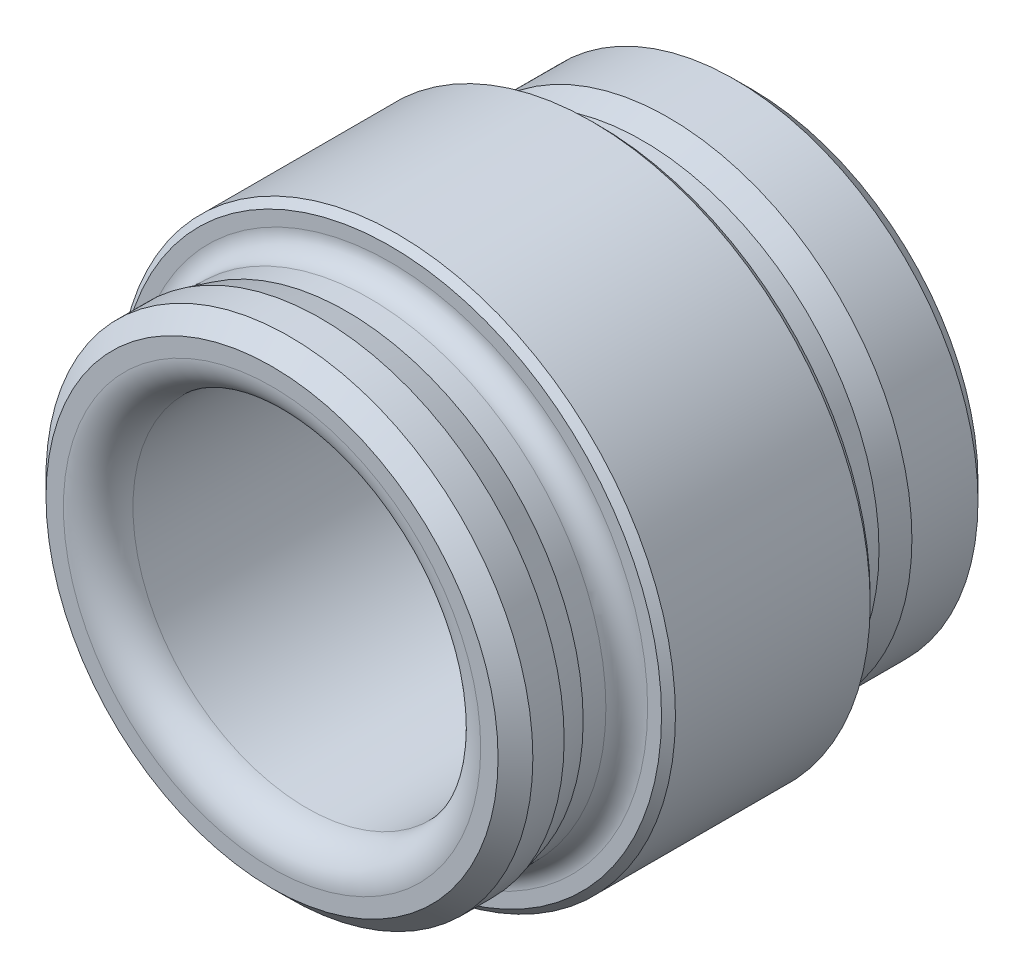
ISO-10303-21;
HEADER;
FILE_DESCRIPTION(('STEP AP214'),'2;1');
FILE_NAME('part.step','',(''),(''),'','','');
FILE_SCHEMA(('AUTOMOTIVE_DESIGN { 1 0 10303 214 1 1 1 1 }'));
ENDSEC;
DATA;
#1=APPLICATION_CONTEXT('core data for automotive mechanical design processes');
#2=APPLICATION_PROTOCOL_DEFINITION('international standard','automotive_design',2000,#1);
#3=PRODUCT_CONTEXT('',#1,'mechanical');
#4=PRODUCT('Part','Part','',(#3));
#5=PRODUCT_RELATED_PRODUCT_CATEGORY('part','',(#4));
#6=PRODUCT_DEFINITION_FORMATION('','',#4);
#7=PRODUCT_DEFINITION_CONTEXT('part definition',#1,'design');
#8=PRODUCT_DEFINITION('design','',#6,#7);
#9=PRODUCT_DEFINITION_SHAPE('','',#8);
#10=(LENGTH_UNIT() NAMED_UNIT(*) SI_UNIT(.MILLI.,.METRE.));
#11=(NAMED_UNIT(*) PLANE_ANGLE_UNIT() SI_UNIT($,.RADIAN.));
#12=(NAMED_UNIT(*) SI_UNIT($,.STERADIAN.) SOLID_ANGLE_UNIT());
#13=UNCERTAINTY_MEASURE_WITH_UNIT(LENGTH_MEASURE(1.E-05),#10,'distance_accuracy_value','');
#14=(GEOMETRIC_REPRESENTATION_CONTEXT(3) GLOBAL_UNCERTAINTY_ASSIGNED_CONTEXT((#13)) GLOBAL_UNIT_ASSIGNED_CONTEXT((#10,
#11,#12)) REPRESENTATION_CONTEXT('',''));
#15=CARTESIAN_POINT('',(0.,0.,0.));
#16=DIRECTION('',(0.,0.,1.));
#17=DIRECTION('',(1.,0.,0.));
#18=AXIS2_PLACEMENT_3D('',#15,#16,#17);
#19=CARTESIAN_POINT('',(0.,0.,8.40000000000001));
#20=DIRECTION('',(0.,0.,1.));
#21=DIRECTION('',(1.,0.,0.));
#22=AXIS2_PLACEMENT_3D('',#19,#20,#21);
#23=TOROIDAL_SURFACE('',#22,6.,0.999999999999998);
#24=CARTESIAN_POINT('',(0.,0.,8.40000000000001));
#25=DIRECTION('',(0.,0.,1.));
#26=DIRECTION('',(1.,0.,0.));
#27=AXIS2_PLACEMENT_3D('',#24,#25,#26);
#28=CIRCLE('',#27,5.);
#29=CARTESIAN_POINT('',(5.,0.,8.40000000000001));
#30=VERTEX_POINT('',#29);
#31=EDGE_CURVE('E10',#30,#30,#28,.T.);
#32=ORIENTED_EDGE('',*,*,#31,.F.);
#33=EDGE_LOOP('',(#32));
#34=FACE_BOUND('',#33,.T.);
#35=CARTESIAN_POINT('',(0.,0.,9.40000000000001));
#36=DIRECTION('',(0.,0.,1.));
#37=DIRECTION('',(1.,0.,0.));
#38=AXIS2_PLACEMENT_3D('',#35,#36,#37);
#39=CIRCLE('',#38,6.);
#40=CARTESIAN_POINT('',(6.,0.,9.40000000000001));
#41=VERTEX_POINT('',#40);
#42=EDGE_CURVE('E95',#41,#41,#39,.T.);
#43=ORIENTED_EDGE('',*,*,#42,.T.);
#44=EDGE_LOOP('',(#43));
#45=FACE_BOUND('',#44,.T.);
#46=ADVANCED_FACE('F34',(#34,#45),#23,.T.);
#47=CARTESIAN_POINT('',(0.,0.,9.40000000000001));
#48=DIRECTION('',(0.,0.,1.));
#49=DIRECTION('',(1.,0.,0.));
#50=AXIS2_PLACEMENT_3D('',#47,#48,#49);
#51=CYLINDRICAL_SURFACE('',#50,5.);
#52=CARTESIAN_POINT('',(0.,0.,-4.39999999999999));
#53=DIRECTION('',(0.,0.,1.));
#54=DIRECTION('',(1.,0.,0.));
#55=AXIS2_PLACEMENT_3D('',#52,#53,#54);
#56=CIRCLE('',#55,5.);
#57=CARTESIAN_POINT('',(5.,0.,-4.39999999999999));
#58=VERTEX_POINT('',#57);
#59=EDGE_CURVE('E40',#58,#58,#56,.T.);
#60=ORIENTED_EDGE('',*,*,#59,.F.);
#61=EDGE_LOOP('',(#60));
#62=FACE_BOUND('',#61,.T.);
#63=ORIENTED_EDGE('',*,*,#31,.T.);
#64=EDGE_LOOP('',(#63));
#65=FACE_BOUND('',#64,.T.);
#66=ADVANCED_FACE('F198',(#62,#65),#51,.F.);
#67=CARTESIAN_POINT('',(0.,5.,-4.39999999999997));
#68=DIRECTION('',(0.,0.,1.));
#69=DIRECTION('',(1.,0.,0.));
#70=AXIS2_PLACEMENT_3D('',#67,#68,#69);
#71=PLANE('',#70);
#72=CARTESIAN_POINT('',(0.,0.,-4.39999999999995));
#73=DIRECTION('',(0.,0.,1.));
#74=DIRECTION('',(1.,0.,0.));
#75=AXIS2_PLACEMENT_3D('',#72,#73,#74);
#76=CIRCLE('',#75,6.49999999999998);
#77=CARTESIAN_POINT('',(6.49999999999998,0.,-4.39999999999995));
#78=VERTEX_POINT('',#77);
#79=EDGE_CURVE('E44',#78,#78,#76,.T.);
#80=ORIENTED_EDGE('',*,*,#79,.F.);
#81=EDGE_LOOP('',(#80));
#82=FACE_BOUND('',#81,.T.);
#83=ORIENTED_EDGE('',*,*,#59,.T.);
#84=EDGE_LOOP('',(#83));
#85=FACE_BOUND('',#84,.T.);
#86=ADVANCED_FACE('F193',(#82,#85),#71,.F.);
#87=CARTESIAN_POINT('',(0.,0.,-4.39999999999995));
#88=DIRECTION('',(0.,0.,1.));
#89=DIRECTION('',(1.,0.,0.));
#90=AXIS2_PLACEMENT_3D('',#87,#88,#89);
#91=CONICAL_SURFACE('',#90,6.49999999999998,0.785398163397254);
#92=CARTESIAN_POINT('',(0.,0.,-3.89999999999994));
#93=DIRECTION('',(0.,0.,1.));
#94=DIRECTION('',(1.,0.,0.));
#95=AXIS2_PLACEMENT_3D('',#92,#93,#94);
#96=CIRCLE('',#95,6.99999999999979);
#97=CARTESIAN_POINT('',(6.99999999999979,0.,-3.89999999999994));
#98=VERTEX_POINT('',#97);
#99=EDGE_CURVE('E48',#98,#98,#96,.T.);
#100=ORIENTED_EDGE('',*,*,#99,.F.);
#101=EDGE_LOOP('',(#100));
#102=FACE_BOUND('',#101,.T.);
#103=ORIENTED_EDGE('',*,*,#79,.T.);
#104=EDGE_LOOP('',(#103));
#105=FACE_BOUND('',#104,.T.);
#106=ADVANCED_FACE('F187',(#102,#105),#91,.T.);
#107=CARTESIAN_POINT('',(0.,0.,9.40000000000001));
#108=DIRECTION('',(0.,0.,1.));
#109=DIRECTION('',(1.,0.,0.));
#110=AXIS2_PLACEMENT_3D('',#107,#108,#109);
#111=CYLINDRICAL_SURFACE('',#110,6.99999999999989);
#112=CARTESIAN_POINT('',(0.,0.,-2.));
#113=DIRECTION('',(0.,0.,1.));
#114=DIRECTION('',(1.,0.,0.));
#115=AXIS2_PLACEMENT_3D('',#112,#113,#114);
#116=CIRCLE('',#115,7.);
#117=CARTESIAN_POINT('',(7.,0.,-2.));
#118=VERTEX_POINT('',#117);
#119=EDGE_CURVE('E53',#118,#118,#116,.T.);
#120=ORIENTED_EDGE('',*,*,#119,.F.);
#121=EDGE_LOOP('',(#120));
#122=FACE_BOUND('',#121,.T.);
#123=ORIENTED_EDGE('',*,*,#99,.T.);
#124=EDGE_LOOP('',(#123));
#125=FACE_BOUND('',#124,.T.);
#126=ADVANCED_FACE('F181',(#122,#125),#111,.T.);
#127=CARTESIAN_POINT('',(0.,0.,-2.));
#128=DIRECTION('',(0.,0.,-1.));
#129=DIRECTION('',(-1.,0.,0.));
#130=AXIS2_PLACEMENT_3D('',#127,#128,#129);
#131=CONICAL_SURFACE('',#130,7.,0.261799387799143);
#132=CARTESIAN_POINT('',(0.,0.,-1.2535898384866));
#133=DIRECTION('',(0.,0.,1.));
#134=DIRECTION('',(1.,0.,0.));
#135=AXIS2_PLACEMENT_3D('',#132,#133,#134);
#136=CIRCLE('',#135,6.80000000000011);
#137=CARTESIAN_POINT('',(6.80000000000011,0.,-1.2535898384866));
#138=VERTEX_POINT('',#137);
#139=EDGE_CURVE('E56',#138,#138,#136,.T.);
#140=ORIENTED_EDGE('',*,*,#139,.F.);
#141=EDGE_LOOP('',(#140));
#142=FACE_BOUND('',#141,.T.);
#143=ORIENTED_EDGE('',*,*,#119,.T.);
#144=EDGE_LOOP('',(#143));
#145=FACE_BOUND('',#144,.T.);
#146=ADVANCED_FACE('F175',(#142,#145),#131,.T.);
#147=CARTESIAN_POINT('',(0.,0.,9.40000000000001));
#148=DIRECTION('',(0.,0.,1.));
#149=DIRECTION('',(1.,0.,0.));
#150=AXIS2_PLACEMENT_3D('',#147,#148,#149);
#151=CYLINDRICAL_SURFACE('',#150,6.80000000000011);
#152=CARTESIAN_POINT('',(0.,0.,-0.6));
#153=DIRECTION('',(0.,0.,1.));
#154=DIRECTION('',(1.,0.,0.));
#155=AXIS2_PLACEMENT_3D('',#152,#153,#154);
#156=CIRCLE('',#155,6.80000000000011);
#157=CARTESIAN_POINT('',(6.80000000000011,0.,-0.6));
#158=VERTEX_POINT('',#157);
#159=EDGE_CURVE('E59',#158,#158,#156,.T.);
#160=ORIENTED_EDGE('',*,*,#159,.F.);
#161=EDGE_LOOP('',(#160));
#162=FACE_BOUND('',#161,.T.);
#163=ORIENTED_EDGE('',*,*,#139,.T.);
#164=EDGE_LOOP('',(#163));
#165=FACE_BOUND('',#164,.T.);
#166=ADVANCED_FACE('F169',(#162,#165),#151,.T.);
#167=CARTESIAN_POINT('',(0.,0.,-0.6));
#168=DIRECTION('',(0.,0.,1.));
#169=DIRECTION('',(1.,0.,0.));
#170=AXIS2_PLACEMENT_3D('',#167,#168,#169);
#171=TOROIDAL_SURFACE('',#170,7.40000000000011,0.599999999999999);
#172=CARTESIAN_POINT('',(0.,0.,0.));
#173=DIRECTION('',(0.,0.,1.));
#174=DIRECTION('',(1.,0.,0.));
#175=AXIS2_PLACEMENT_3D('',#172,#173,#174);
#176=CIRCLE('',#175,7.40000000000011);
#177=CARTESIAN_POINT('',(7.40000000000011,0.,0.));
#178=VERTEX_POINT('',#177);
#179=EDGE_CURVE('E62',#178,#178,#176,.T.);
#180=ORIENTED_EDGE('',*,*,#179,.F.);
#181=EDGE_LOOP('',(#180));
#182=FACE_BOUND('',#181,.T.);
#183=ORIENTED_EDGE('',*,*,#159,.T.);
#184=EDGE_LOOP('',(#183));
#185=FACE_BOUND('',#184,.T.);
#186=ADVANCED_FACE('F163',(#182,#185),#171,.F.);
#187=CARTESIAN_POINT('',(0.,7.40000000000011,0.));
#188=DIRECTION('',(0.,0.,1.));
#189=DIRECTION('',(1.,0.,0.));
#190=AXIS2_PLACEMENT_3D('',#187,#188,#189);
#191=PLANE('',#190);
#192=CARTESIAN_POINT('',(0.,0.,0.));
#193=DIRECTION('',(0.,0.,1.));
#194=DIRECTION('',(1.,0.,0.));
#195=AXIS2_PLACEMENT_3D('',#192,#193,#194);
#196=CIRCLE('',#195,7.8);
#197=CARTESIAN_POINT('',(7.8,0.,0.));
#198=VERTEX_POINT('',#197);
#199=EDGE_CURVE('E65',#198,#198,#196,.T.);
#200=ORIENTED_EDGE('',*,*,#199,.F.);
#201=EDGE_LOOP('',(#200));
#202=FACE_BOUND('',#201,.T.);
#203=ORIENTED_EDGE('',*,*,#179,.T.);
#204=EDGE_LOOP('',(#203));
#205=FACE_BOUND('',#204,.T.);
#206=ADVANCED_FACE('F157',(#202,#205),#191,.F.);
#207=CARTESIAN_POINT('',(0.,0.,0.));
#208=DIRECTION('',(0.,0.,1.));
#209=DIRECTION('',(1.,0.,0.));
#210=AXIS2_PLACEMENT_3D('',#207,#208,#209);
#211=CONICAL_SURFACE('',#210,7.8,0.785398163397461);
#212=CARTESIAN_POINT('',(0.,0.,0.200000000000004));
#213=DIRECTION('',(0.,0.,1.));
#214=DIRECTION('',(1.,0.,0.));
#215=AXIS2_PLACEMENT_3D('',#212,#213,#214);
#216=CIRCLE('',#215,8.);
#217=CARTESIAN_POINT('',(8.,0.,0.200000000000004));
#218=VERTEX_POINT('',#217);
#219=EDGE_CURVE('E68',#218,#218,#216,.T.);
#220=ORIENTED_EDGE('',*,*,#219,.F.);
#221=EDGE_LOOP('',(#220));
#222=FACE_BOUND('',#221,.T.);
#223=ORIENTED_EDGE('',*,*,#199,.T.);
#224=EDGE_LOOP('',(#223));
#225=FACE_BOUND('',#224,.T.);
#226=ADVANCED_FACE('F151',(#222,#225),#211,.T.);
#227=CARTESIAN_POINT('',(0.,0.,9.40000000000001));
#228=DIRECTION('',(0.,0.,1.));
#229=DIRECTION('',(1.,0.,0.));
#230=AXIS2_PLACEMENT_3D('',#227,#228,#229);
#231=CYLINDRICAL_SURFACE('',#230,8.);
#232=CARTESIAN_POINT('',(0.,0.,5.80000000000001));
#233=DIRECTION('',(0.,0.,1.));
#234=DIRECTION('',(1.,0.,0.));
#235=AXIS2_PLACEMENT_3D('',#232,#233,#234);
#236=CIRCLE('',#235,8.);
#237=CARTESIAN_POINT('',(8.,0.,5.80000000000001));
#238=VERTEX_POINT('',#237);
#239=EDGE_CURVE('E71',#238,#238,#236,.T.);
#240=ORIENTED_EDGE('',*,*,#239,.F.);
#241=EDGE_LOOP('',(#240));
#242=FACE_BOUND('',#241,.T.);
#243=ORIENTED_EDGE('',*,*,#219,.T.);
#244=EDGE_LOOP('',(#243));
#245=FACE_BOUND('',#244,.T.);
#246=ADVANCED_FACE('F145',(#242,#245),#231,.T.);
#247=CARTESIAN_POINT('',(0.,0.,5.80000000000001));
#248=DIRECTION('',(0.,0.,-1.));
#249=DIRECTION('',(-1.,0.,0.));
#250=AXIS2_PLACEMENT_3D('',#247,#248,#249);
#251=CONICAL_SURFACE('',#250,8.,0.785398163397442);
#252=CARTESIAN_POINT('',(0.,0.,6.00000000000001));
#253=DIRECTION('',(0.,0.,1.));
#254=DIRECTION('',(1.,0.,0.));
#255=AXIS2_PLACEMENT_3D('',#252,#253,#254);
#256=CIRCLE('',#255,7.8);
#257=CARTESIAN_POINT('',(7.8,0.,6.00000000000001));
#258=VERTEX_POINT('',#257);
#259=EDGE_CURVE('E74',#258,#258,#256,.T.);
#260=ORIENTED_EDGE('',*,*,#259,.F.);
#261=EDGE_LOOP('',(#260));
#262=FACE_BOUND('',#261,.T.);
#263=ORIENTED_EDGE('',*,*,#239,.T.);
#264=EDGE_LOOP('',(#263));
#265=FACE_BOUND('',#264,.T.);
#266=ADVANCED_FACE('F139',(#262,#265),#251,.T.);
#267=CARTESIAN_POINT('',(0.,7.8,6.00000000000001));
#268=DIRECTION('',(0.,0.,-1.));
#269=DIRECTION('',(-1.,0.,0.));
#270=AXIS2_PLACEMENT_3D('',#267,#268,#269);
#271=PLANE('',#270);
#272=CARTESIAN_POINT('',(0.,0.,6.00000000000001));
#273=DIRECTION('',(0.,0.,1.));
#274=DIRECTION('',(1.,0.,0.));
#275=AXIS2_PLACEMENT_3D('',#272,#273,#274);
#276=CIRCLE('',#275,7.40000000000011);
#277=CARTESIAN_POINT('',(7.40000000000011,0.,6.00000000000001));
#278=VERTEX_POINT('',#277);
#279=EDGE_CURVE('E77',#278,#278,#276,.T.);
#280=ORIENTED_EDGE('',*,*,#279,.F.);
#281=EDGE_LOOP('',(#280));
#282=FACE_BOUND('',#281,.T.);
#283=ORIENTED_EDGE('',*,*,#259,.T.);
#284=EDGE_LOOP('',(#283));
#285=FACE_BOUND('',#284,.T.);
#286=ADVANCED_FACE('F133',(#282,#285),#271,.F.);
#287=CARTESIAN_POINT('',(0.,0.,6.6));
#288=DIRECTION('',(0.,0.,1.));
#289=DIRECTION('',(1.,0.,0.));
#290=AXIS2_PLACEMENT_3D('',#287,#288,#289);
#291=TOROIDAL_SURFACE('',#290,7.40000000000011,0.599999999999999);
#292=CARTESIAN_POINT('',(0.,0.,6.6));
#293=DIRECTION('',(0.,0.,1.));
#294=DIRECTION('',(1.,0.,0.));
#295=AXIS2_PLACEMENT_3D('',#292,#293,#294);
#296=CIRCLE('',#295,6.80000000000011);
#297=CARTESIAN_POINT('',(6.80000000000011,0.,6.6));
#298=VERTEX_POINT('',#297);
#299=EDGE_CURVE('E80',#298,#298,#296,.T.);
#300=ORIENTED_EDGE('',*,*,#299,.F.);
#301=EDGE_LOOP('',(#300));
#302=FACE_BOUND('',#301,.T.);
#303=ORIENTED_EDGE('',*,*,#279,.T.);
#304=EDGE_LOOP('',(#303));
#305=FACE_BOUND('',#304,.T.);
#306=ADVANCED_FACE('F127',(#302,#305),#291,.F.);
#307=CARTESIAN_POINT('',(0.,0.,9.40000000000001));
#308=DIRECTION('',(0.,0.,1.));
#309=DIRECTION('',(1.,0.,0.));
#310=AXIS2_PLACEMENT_3D('',#307,#308,#309);
#311=CYLINDRICAL_SURFACE('',#310,6.80000000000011);
#312=CARTESIAN_POINT('',(0.,0.,7.25358983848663));
#313=DIRECTION('',(0.,0.,1.));
#314=DIRECTION('',(1.,0.,0.));
#315=AXIS2_PLACEMENT_3D('',#312,#313,#314);
#316=CIRCLE('',#315,6.80000000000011);
#317=CARTESIAN_POINT('',(6.80000000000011,0.,7.25358983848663));
#318=VERTEX_POINT('',#317);
#319=EDGE_CURVE('E83',#318,#318,#316,.T.);
#320=ORIENTED_EDGE('',*,*,#319,.F.);
#321=EDGE_LOOP('',(#320));
#322=FACE_BOUND('',#321,.T.);
#323=ORIENTED_EDGE('',*,*,#299,.T.);
#324=EDGE_LOOP('',(#323));
#325=FACE_BOUND('',#324,.T.);
#326=ADVANCED_FACE('F121',(#322,#325),#311,.T.);
#327=CARTESIAN_POINT('',(0.,0.,7.25358983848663));
#328=DIRECTION('',(0.,0.,1.));
#329=DIRECTION('',(1.,0.,0.));
#330=AXIS2_PLACEMENT_3D('',#327,#328,#329);
#331=CONICAL_SURFACE('',#330,6.80000000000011,0.261799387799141);
#332=CARTESIAN_POINT('',(0.,0.,8.00000000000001));
#333=DIRECTION('',(0.,0.,1.));
#334=DIRECTION('',(1.,0.,0.));
#335=AXIS2_PLACEMENT_3D('',#332,#333,#334);
#336=CIRCLE('',#335,7.);
#337=CARTESIAN_POINT('',(7.,0.,8.00000000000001));
#338=VERTEX_POINT('',#337);
#339=EDGE_CURVE('E86',#338,#338,#336,.T.);
#340=ORIENTED_EDGE('',*,*,#339,.F.);
#341=EDGE_LOOP('',(#340));
#342=FACE_BOUND('',#341,.T.);
#343=ORIENTED_EDGE('',*,*,#319,.T.);
#344=EDGE_LOOP('',(#343));
#345=FACE_BOUND('',#344,.T.);
#346=ADVANCED_FACE('F115',(#342,#345),#331,.T.);
#347=CARTESIAN_POINT('',(0.,0.,9.40000000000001));
#348=DIRECTION('',(0.,0.,1.));
#349=DIRECTION('',(1.,0.,0.));
#350=AXIS2_PLACEMENT_3D('',#347,#348,#349);
#351=CYLINDRICAL_SURFACE('',#350,7.);
#352=CARTESIAN_POINT('',(0.,0.,8.9));
#353=DIRECTION('',(0.,0.,1.));
#354=DIRECTION('',(1.,0.,0.));
#355=AXIS2_PLACEMENT_3D('',#352,#353,#354);
#356=CIRCLE('',#355,7.);
#357=CARTESIAN_POINT('',(7.,0.,8.9));
#358=VERTEX_POINT('',#357);
#359=EDGE_CURVE('E89',#358,#358,#356,.T.);
#360=ORIENTED_EDGE('',*,*,#359,.F.);
#361=EDGE_LOOP('',(#360));
#362=FACE_BOUND('',#361,.T.);
#363=ORIENTED_EDGE('',*,*,#339,.T.);
#364=EDGE_LOOP('',(#363));
#365=FACE_BOUND('',#364,.T.);
#366=ADVANCED_FACE('F109',(#362,#365),#351,.T.);
#367=CARTESIAN_POINT('',(0.,0.,8.9));
#368=DIRECTION('',(0.,0.,-1.));
#369=DIRECTION('',(-1.,0.,0.));
#370=AXIS2_PLACEMENT_3D('',#367,#368,#369);
#371=CONICAL_SURFACE('',#370,7.,0.785398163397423);
#372=CARTESIAN_POINT('',(0.,0.,9.40000000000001));
#373=DIRECTION('',(0.,0.,1.));
#374=DIRECTION('',(1.,0.,0.));
#375=AXIS2_PLACEMENT_3D('',#372,#373,#374);
#376=CIRCLE('',#375,6.50000000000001);
#377=CARTESIAN_POINT('',(6.50000000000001,0.,9.40000000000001));
#378=VERTEX_POINT('',#377);
#379=EDGE_CURVE('E92',#378,#378,#376,.T.);
#380=ORIENTED_EDGE('',*,*,#379,.F.);
#381=EDGE_LOOP('',(#380));
#382=FACE_BOUND('',#381,.T.);
#383=ORIENTED_EDGE('',*,*,#359,.T.);
#384=EDGE_LOOP('',(#383));
#385=FACE_BOUND('',#384,.T.);
#386=ADVANCED_FACE('F103',(#382,#385),#371,.T.);
#387=CARTESIAN_POINT('',(0.,6.50000000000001,9.40000000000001));
#388=DIRECTION('',(0.,0.,-1.));
#389=DIRECTION('',(-1.,0.,0.));
#390=AXIS2_PLACEMENT_3D('',#387,#388,#389);
#391=PLANE('',#390);
#392=ORIENTED_EDGE('',*,*,#42,.F.);
#393=EDGE_LOOP('',(#392));
#394=FACE_BOUND('',#393,.T.);
#395=ORIENTED_EDGE('',*,*,#379,.T.);
#396=EDGE_LOOP('',(#395));
#397=FACE_BOUND('',#396,.T.);
#398=ADVANCED_FACE('F100',(#394,#397),#391,.F.);
#399=CLOSED_SHELL('',(#46,#66,#86,#106,#126,#146,#166,#186,#206,#226,#246,#266,#286,#306,#326,
#346,#366,#386,#398));
#400=MANIFOLD_SOLID_BREP('B2',#399);
#401=ADVANCED_BREP_SHAPE_REPRESENTATION('',(#18,#400),#14);
#402=SHAPE_DEFINITION_REPRESENTATION(#9,#401);
ENDSEC;
END-ISO-10303-21;
